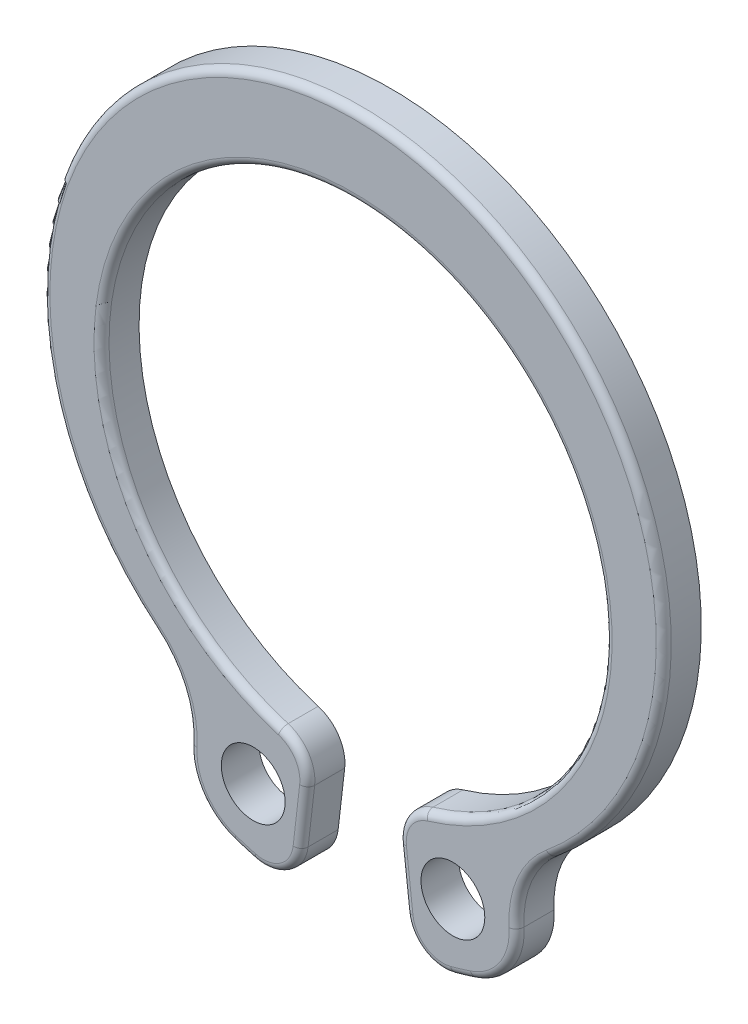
ISO-10303-21;
HEADER;
FILE_DESCRIPTION(('STEP AP214'),'2;1');
FILE_NAME('part.step','',(''),(''),'','','');
FILE_SCHEMA(('AUTOMOTIVE_DESIGN { 1 0 10303 214 1 1 1 1 }'));
ENDSEC;
DATA;
#1=APPLICATION_CONTEXT('core data for automotive mechanical design processes');
#2=APPLICATION_PROTOCOL_DEFINITION('international standard','automotive_design',2000,#1);
#3=PRODUCT_CONTEXT('',#1,'mechanical');
#4=PRODUCT('Part','Part','',(#3));
#5=PRODUCT_RELATED_PRODUCT_CATEGORY('part','',(#4));
#6=PRODUCT_DEFINITION_FORMATION('','',#4);
#7=PRODUCT_DEFINITION_CONTEXT('part definition',#1,'design');
#8=PRODUCT_DEFINITION('design','',#6,#7);
#9=PRODUCT_DEFINITION_SHAPE('','',#8);
#10=(LENGTH_UNIT() NAMED_UNIT(*) SI_UNIT(.MILLI.,.METRE.));
#11=(NAMED_UNIT(*) PLANE_ANGLE_UNIT() SI_UNIT($,.RADIAN.));
#12=(NAMED_UNIT(*) SI_UNIT($,.STERADIAN.) SOLID_ANGLE_UNIT());
#13=UNCERTAINTY_MEASURE_WITH_UNIT(LENGTH_MEASURE(1.E-05),#10,'distance_accuracy_value','');
#14=(GEOMETRIC_REPRESENTATION_CONTEXT(3) GLOBAL_UNCERTAINTY_ASSIGNED_CONTEXT((#13)) GLOBAL_UNIT_ASSIGNED_CONTEXT((#10,
#11,#12)) REPRESENTATION_CONTEXT('',''));
#15=CARTESIAN_POINT('',(0.,0.,0.));
#16=DIRECTION('',(0.,0.,1.));
#17=DIRECTION('',(1.,0.,0.));
#18=AXIS2_PLACEMENT_3D('',#15,#16,#17);
#19=CARTESIAN_POINT('',(0.,0.,1.));
#20=DIRECTION('',(0.,0.,1.));
#21=DIRECTION('',(1.,0.,0.));
#22=AXIS2_PLACEMENT_3D('',#19,#20,#21);
#23=PLANE('',#22);
#24=DIRECTION('',(0.115000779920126,0.99336540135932,0.));
#25=VECTOR('',#24,1.);
#26=CARTESIAN_POINT('',(-1.42123311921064,-7.46625817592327,1.));
#27=LINE('',#26,#25);
#28=CARTESIAN_POINT('',(-1.59563669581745,-8.97273907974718,1.));
#29=VERTEX_POINT('',#28);
#30=CARTESIAN_POINT('',(-1.42123311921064,-7.46625817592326,1.));
#31=VERTEX_POINT('',#30);
#32=EDGE_CURVE('E279',#29,#31,#27,.T.);
#33=ORIENTED_EDGE('',*,*,#32,.T.);
#34=CARTESIAN_POINT('',(-2.21592544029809,-7.37425755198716,1.));
#35=DIRECTION('',(0.,0.,1.));
#36=DIRECTION('',(1.,0.,0.));
#37=AXIS2_PLACEMENT_3D('',#34,#35,#36);
#38=CIRCLE('',#37,0.8);
#39=CARTESIAN_POINT('',(-1.98569942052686,-6.60810092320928,1.));
#40=VERTEX_POINT('',#39);
#41=EDGE_CURVE('E281',#31,#40,#38,.T.);
#42=ORIENTED_EDGE('',*,*,#41,.T.);
#43=CARTESIAN_POINT('',(0.,0.,1.));
#44=DIRECTION('',(0.,0.,1.));
#45=DIRECTION('',(1.,0.,0.));
#46=AXIS2_PLACEMENT_3D('',#43,#44,#45);
#47=CIRCLE('',#46,6.9);
#48=CARTESIAN_POINT('',(1.98569942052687,-6.60810092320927,1.));
#49=VERTEX_POINT('',#48);
#50=EDGE_CURVE('E255',#40,#49,#47,.F.);
#51=ORIENTED_EDGE('',*,*,#50,.T.);
#52=CARTESIAN_POINT('',(2.2159254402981,-7.37425755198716,1.));
#53=DIRECTION('',(0.,0.,1.));
#54=DIRECTION('',(1.,0.,0.));
#55=AXIS2_PLACEMENT_3D('',#52,#53,#54);
#56=CIRCLE('',#55,0.8);
#57=CARTESIAN_POINT('',(1.42123311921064,-7.46625817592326,1.));
#58=VERTEX_POINT('',#57);
#59=EDGE_CURVE('E257',#49,#58,#56,.T.);
#60=ORIENTED_EDGE('',*,*,#59,.T.);
#61=DIRECTION('',(0.115000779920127,-0.99336540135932,0.));
#62=VECTOR('',#61,1.);
#63=CARTESIAN_POINT('',(1.59563669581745,-8.97273907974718,1.));
#64=LINE('',#63,#62);
#65=CARTESIAN_POINT('',(1.59563669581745,-8.97273907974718,1.));
#66=VERTEX_POINT('',#65);
#67=EDGE_CURVE('E259',#58,#66,#64,.T.);
#68=ORIENTED_EDGE('',*,*,#67,.T.);
#69=CARTESIAN_POINT('',(2.39032901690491,-8.88073845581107,1.));
#70=DIRECTION('',(0.,0.,1.));
#71=DIRECTION('',(1.,0.,0.));
#72=AXIS2_PLACEMENT_3D('',#69,#70,#71);
#73=CIRCLE('',#72,0.8);
#74=CARTESIAN_POINT('',(2.59825596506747,-9.65324501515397,1.));
#75=VERTEX_POINT('',#74);
#76=EDGE_CURVE('E261',#66,#75,#73,.T.);
#77=ORIENTED_EDGE('',*,*,#76,.T.);
#78=CARTESIAN_POINT('',(0.,0.,1.));
#79=DIRECTION('',(0.,0.,1.));
#80=DIRECTION('',(1.,0.,0.));
#81=AXIS2_PLACEMENT_3D('',#78,#79,#80);
#82=CIRCLE('',#81,9.99680315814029);
#83=CARTESIAN_POINT('',(3.12827428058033,-9.49473398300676,1.));
#84=VERTEX_POINT('',#83);
#85=EDGE_CURVE('E263',#75,#84,#82,.T.);
#86=ORIENTED_EDGE('',*,*,#85,.T.);
#87=CARTESIAN_POINT('',(2.65888308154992,-8.07006844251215,1.));
#88=DIRECTION('',(0.,0.,1.));
#89=DIRECTION('',(1.,0.,0.));
#90=AXIS2_PLACEMENT_3D('',#87,#88,#89);
#91=CIRCLE('',#90,1.5);
#92=CARTESIAN_POINT('',(4.15617696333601,-7.98000717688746,1.));
#93=VERTEX_POINT('',#92);
#94=EDGE_CURVE('E265',#84,#93,#91,.T.);
#95=ORIENTED_EDGE('',*,*,#94,.T.);
#96=CARTESIAN_POINT('',(6.90121574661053,-7.81489485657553,1.));
#97=DIRECTION('',(0.,0.,1.));
#98=DIRECTION('',(1.,0.,0.));
#99=AXIS2_PLACEMENT_3D('',#96,#97,#98);
#100=CIRCLE('',#99,2.75);
#101=CARTESIAN_POINT('',(5.14802006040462,-5.69621486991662,1.));
#102=VERTEX_POINT('',#101);
#103=EDGE_CURVE('E267',#93,#102,#100,.F.);
#104=ORIENTED_EDGE('',*,*,#103,.T.);
#105=CARTESIAN_POINT('',(0.,0.525,1.));
#106=DIRECTION('',(0.,0.,1.));
#107=DIRECTION('',(1.,0.,0.));
#108=AXIS2_PLACEMENT_3D('',#105,#106,#107);
#109=CIRCLE('',#108,8.075);
#110=CARTESIAN_POINT('',(-5.14802006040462,-5.69621486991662,1.));
#111=VERTEX_POINT('',#110);
#112=EDGE_CURVE('E269',#102,#111,#109,.T.);
#113=ORIENTED_EDGE('',*,*,#112,.T.);
#114=CARTESIAN_POINT('',(-6.90121574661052,-7.81489485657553,1.));
#115=DIRECTION('',(0.,0.,1.));
#116=DIRECTION('',(1.,0.,0.));
#117=AXIS2_PLACEMENT_3D('',#114,#115,#116);
#118=CIRCLE('',#117,2.75);
#119=CARTESIAN_POINT('',(-4.15617696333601,-7.98000717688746,1.));
#120=VERTEX_POINT('',#119);
#121=EDGE_CURVE('E271',#111,#120,#118,.F.);
#122=ORIENTED_EDGE('',*,*,#121,.T.);
#123=CARTESIAN_POINT('',(-2.65888308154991,-8.07006844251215,1.));
#124=DIRECTION('',(0.,0.,1.));
#125=DIRECTION('',(1.,0.,0.));
#126=AXIS2_PLACEMENT_3D('',#123,#124,#125);
#127=CIRCLE('',#126,1.5);
#128=CARTESIAN_POINT('',(-3.12827428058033,-9.49473398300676,1.));
#129=VERTEX_POINT('',#128);
#130=EDGE_CURVE('E273',#120,#129,#127,.T.);
#131=ORIENTED_EDGE('',*,*,#130,.T.);
#132=CARTESIAN_POINT('',(0.,0.,1.));
#133=DIRECTION('',(0.,0.,1.));
#134=DIRECTION('',(1.,0.,0.));
#135=AXIS2_PLACEMENT_3D('',#132,#133,#134);
#136=CIRCLE('',#135,9.99680315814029);
#137=CARTESIAN_POINT('',(-2.59825596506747,-9.65324501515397,1.));
#138=VERTEX_POINT('',#137);
#139=EDGE_CURVE('E275',#129,#138,#136,.T.);
#140=ORIENTED_EDGE('',*,*,#139,.T.);
#141=CARTESIAN_POINT('',(-2.39032901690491,-8.88073845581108,1.));
#142=DIRECTION('',(0.,0.,1.));
#143=DIRECTION('',(1.,0.,0.));
#144=AXIS2_PLACEMENT_3D('',#141,#142,#143);
#145=CIRCLE('',#144,0.8);
#146=EDGE_CURVE('E277',#138,#29,#145,.T.);
#147=ORIENTED_EDGE('',*,*,#146,.T.);
#148=EDGE_LOOP('',(#33,#42,#51,#60,#68,#77,#86,#95,#104,#113,#122,#131,#140,#147));
#149=FACE_BOUND('',#148,.T.);
#150=CARTESIAN_POINT('',(-2.65888308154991,-8.07006844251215,1.));
#151=DIRECTION('',(0.,0.,1.));
#152=DIRECTION('',(-1.,0.,0.));
#153=AXIS2_PLACEMENT_3D('',#150,#151,#152);
#154=CIRCLE('',#153,0.85);
#155=CARTESIAN_POINT('',(-3.50888308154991,-8.07006844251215,1.));
#156=VERTEX_POINT('',#155);
#157=EDGE_CURVE('E414',#156,#156,#154,.T.);
#158=ORIENTED_EDGE('',*,*,#157,.F.);
#159=EDGE_LOOP('',(#158));
#160=FACE_BOUND('',#159,.T.);
#161=CARTESIAN_POINT('',(2.65888308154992,-8.07006844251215,1.));
#162=DIRECTION('',(0.,0.,1.));
#163=DIRECTION('',(1.,0.,0.));
#164=AXIS2_PLACEMENT_3D('',#161,#162,#163);
#165=CIRCLE('',#164,0.85);
#166=CARTESIAN_POINT('',(3.50888308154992,-8.07006844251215,1.));
#167=VERTEX_POINT('',#166);
#168=EDGE_CURVE('E408',#167,#167,#165,.T.);
#169=ORIENTED_EDGE('',*,*,#168,.F.);
#170=EDGE_LOOP('',(#169));
#171=FACE_BOUND('',#170,.T.);
#172=ADVANCED_FACE('F32',(#149,#160,#171),#23,.T.);
#173=CARTESIAN_POINT('',(0.,0.,0.));
#174=DIRECTION('',(0.,0.,1.));
#175=DIRECTION('',(1.,0.,0.));
#176=AXIS2_PLACEMENT_3D('',#173,#174,#175);
#177=PLANE('',#176);
#178=CARTESIAN_POINT('',(-2.65888308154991,-8.07006844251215,0.));
#179=DIRECTION('',(0.,0.,1.));
#180=DIRECTION('',(-1.,0.,0.));
#181=AXIS2_PLACEMENT_3D('',#178,#179,#180);
#182=CIRCLE('',#181,0.85);
#183=CARTESIAN_POINT('',(-3.50888308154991,-8.07006844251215,0.));
#184=VERTEX_POINT('',#183);
#185=EDGE_CURVE('E411',#184,#184,#182,.T.);
#186=ORIENTED_EDGE('',*,*,#185,.T.);
#187=EDGE_LOOP('',(#186));
#188=FACE_BOUND('',#187,.T.);
#189=CARTESIAN_POINT('',(0.,0.,0.));
#190=DIRECTION('',(0.,0.,1.));
#191=DIRECTION('',(1.,0.,0.));
#192=AXIS2_PLACEMENT_3D('',#189,#190,#191);
#193=CIRCLE('',#192,10.1968031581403);
#194=CARTESIAN_POINT('',(2.65023770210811,-9.8463716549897,0.));
#195=VERTEX_POINT('',#194);
#196=CARTESIAN_POINT('',(3.19085977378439,-9.68468938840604,0.));
#197=VERTEX_POINT('',#196);
#198=EDGE_CURVE('E190',#195,#197,#193,.T.);
#199=ORIENTED_EDGE('',*,*,#198,.F.);
#200=CARTESIAN_POINT('',(2.39032901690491,-8.88073845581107,0.));
#201=DIRECTION('',(0.,0.,1.));
#202=DIRECTION('',(1.,0.,0.));
#203=AXIS2_PLACEMENT_3D('',#200,#201,#202);
#204=CIRCLE('',#203,1.);
#205=CARTESIAN_POINT('',(1.39696361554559,-8.9957392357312,0.));
#206=VERTEX_POINT('',#205);
#207=EDGE_CURVE('E237',#195,#206,#204,.F.);
#208=ORIENTED_EDGE('',*,*,#207,.T.);
#209=DIRECTION('',(0.115000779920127,-0.99336540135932,0.));
#210=VECTOR('',#209,1.);
#211=CARTESIAN_POINT('',(1.12026908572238,-6.60567916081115,0.));
#212=LINE('',#211,#210);
#213=CARTESIAN_POINT('',(1.22256003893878,-7.48925833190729,0.));
#214=VERTEX_POINT('',#213);
#215=EDGE_CURVE('E195',#214,#206,#212,.T.);
#216=ORIENTED_EDGE('',*,*,#215,.F.);
#217=CARTESIAN_POINT('',(2.2159254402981,-7.37425755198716,0.));
#218=DIRECTION('',(0.,0.,1.));
#219=DIRECTION('',(1.,0.,0.));
#220=AXIS2_PLACEMENT_3D('',#217,#218,#219);
#221=CIRCLE('',#220,1.);
#222=CARTESIAN_POINT('',(1.92814291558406,-6.41656176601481,0.));
#223=VERTEX_POINT('',#222);
#224=EDGE_CURVE('E233',#214,#223,#221,.F.);
#225=ORIENTED_EDGE('',*,*,#224,.T.);
#226=CARTESIAN_POINT('',(0.,0.,0.));
#227=DIRECTION('',(0.,0.,-1.));
#228=DIRECTION('',(1.,0.,0.));
#229=AXIS2_PLACEMENT_3D('',#226,#227,#228);
#230=CIRCLE('',#229,6.7);
#231=CARTESIAN_POINT('',(-1.92814291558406,-6.41656176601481,0.));
#232=VERTEX_POINT('',#231);
#233=EDGE_CURVE('E417',#232,#223,#230,.T.);
#234=ORIENTED_EDGE('',*,*,#233,.F.);
#235=CARTESIAN_POINT('',(-2.21592544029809,-7.37425755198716,0.));
#236=DIRECTION('',(0.,0.,1.));
#237=DIRECTION('',(1.,0.,0.));
#238=AXIS2_PLACEMENT_3D('',#235,#236,#237);
#239=CIRCLE('',#238,1.);
#240=CARTESIAN_POINT('',(-1.22256003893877,-7.48925833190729,0.));
#241=VERTEX_POINT('',#240);
#242=EDGE_CURVE('E231',#232,#241,#239,.F.);
#243=ORIENTED_EDGE('',*,*,#242,.T.);
#244=DIRECTION('',(0.115000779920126,0.99336540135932,0.));
#245=VECTOR('',#244,1.);
#246=CARTESIAN_POINT('',(-1.12026908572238,-6.60567916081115,0.));
#247=LINE('',#246,#245);
#248=CARTESIAN_POINT('',(-1.39696361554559,-8.9957392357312,0.));
#249=VERTEX_POINT('',#248);
#250=EDGE_CURVE('E218',#249,#241,#247,.T.);
#251=ORIENTED_EDGE('',*,*,#250,.F.);
#252=CARTESIAN_POINT('',(-2.39032901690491,-8.88073845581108,0.));
#253=DIRECTION('',(0.,0.,1.));
#254=DIRECTION('',(1.,0.,0.));
#255=AXIS2_PLACEMENT_3D('',#252,#253,#254);
#256=CIRCLE('',#255,1.);
#257=CARTESIAN_POINT('',(-2.65023770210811,-9.8463716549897,0.));
#258=VERTEX_POINT('',#257);
#259=EDGE_CURVE('E235',#249,#258,#256,.F.);
#260=ORIENTED_EDGE('',*,*,#259,.T.);
#261=CARTESIAN_POINT('',(0.,0.,0.));
#262=DIRECTION('',(0.,0.,1.));
#263=DIRECTION('',(-1.,0.,0.));
#264=AXIS2_PLACEMENT_3D('',#261,#262,#263);
#265=CIRCLE('',#264,10.1968031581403);
#266=CARTESIAN_POINT('',(-3.19085977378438,-9.68468938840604,0.));
#267=VERTEX_POINT('',#266);
#268=EDGE_CURVE('E215',#267,#258,#265,.T.);
#269=ORIENTED_EDGE('',*,*,#268,.F.);
#270=CARTESIAN_POINT('',(-2.65888308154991,-8.07006844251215,0.));
#271=DIRECTION('',(0.,0.,1.));
#272=DIRECTION('',(-1.,0.,0.));
#273=AXIS2_PLACEMENT_3D('',#270,#271,#272);
#274=CIRCLE('',#273,1.7);
#275=CARTESIAN_POINT('',(-4.35581614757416,-7.9679990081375,0.));
#276=VERTEX_POINT('',#275);
#277=EDGE_CURVE('E212',#276,#267,#274,.T.);
#278=ORIENTED_EDGE('',*,*,#277,.F.);
#279=CARTESIAN_POINT('',(-6.90121574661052,-7.81489485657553,0.));
#280=DIRECTION('',(0.,0.,-1.));
#281=DIRECTION('',(-1.,0.,0.));
#282=AXIS2_PLACEMENT_3D('',#279,#280,#281);
#283=CIRCLE('',#282,2.55);
#284=CARTESIAN_POINT('',(-5.27552520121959,-5.85030068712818,0.));
#285=VERTEX_POINT('',#284);
#286=EDGE_CURVE('E209',#285,#276,#283,.T.);
#287=ORIENTED_EDGE('',*,*,#286,.F.);
#288=CARTESIAN_POINT('',(0.,0.525,0.));
#289=DIRECTION('',(0.,0.,1.));
#290=DIRECTION('',(1.,0.,0.));
#291=AXIS2_PLACEMENT_3D('',#288,#289,#290);
#292=CIRCLE('',#291,8.275);
#293=CARTESIAN_POINT('',(5.27552520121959,-5.85030068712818,0.));
#294=VERTEX_POINT('',#293);
#295=EDGE_CURVE('E203',#294,#285,#292,.T.);
#296=ORIENTED_EDGE('',*,*,#295,.F.);
#297=CARTESIAN_POINT('',(6.90121574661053,-7.81489485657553,0.));
#298=DIRECTION('',(0.,0.,-1.));
#299=DIRECTION('',(1.,0.,0.));
#300=AXIS2_PLACEMENT_3D('',#297,#298,#299);
#301=CIRCLE('',#300,2.55);
#302=CARTESIAN_POINT('',(4.35581614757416,-7.9679990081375,0.));
#303=VERTEX_POINT('',#302);
#304=EDGE_CURVE('E201',#303,#294,#301,.T.);
#305=ORIENTED_EDGE('',*,*,#304,.F.);
#306=CARTESIAN_POINT('',(2.65888308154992,-8.07006844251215,0.));
#307=DIRECTION('',(0.,0.,1.));
#308=DIRECTION('',(1.,0.,0.));
#309=AXIS2_PLACEMENT_3D('',#306,#307,#308);
#310=CIRCLE('',#309,1.7);
#311=EDGE_CURVE('E180',#197,#303,#310,.T.);
#312=ORIENTED_EDGE('',*,*,#311,.F.);
#313=EDGE_LOOP('',(#199,#208,#216,#225,#234,#243,#251,#260,#269,#278,#287,#296,#305,#312));
#314=FACE_BOUND('',#313,.T.);
#315=CARTESIAN_POINT('',(2.65888308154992,-8.07006844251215,0.));
#316=DIRECTION('',(0.,0.,1.));
#317=DIRECTION('',(1.,0.,0.));
#318=AXIS2_PLACEMENT_3D('',#315,#316,#317);
#319=CIRCLE('',#318,0.85);
#320=CARTESIAN_POINT('',(3.50888308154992,-8.07006844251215,0.));
#321=VERTEX_POINT('',#320);
#322=EDGE_CURVE('E405',#321,#321,#319,.T.);
#323=ORIENTED_EDGE('',*,*,#322,.T.);
#324=EDGE_LOOP('',(#323));
#325=FACE_BOUND('',#324,.T.);
#326=ADVANCED_FACE('F197',(#188,#314,#325),#177,.F.);
#327=CARTESIAN_POINT('',(0.,0.,1.));
#328=DIRECTION('',(0.,0.,-1.));
#329=DIRECTION('',(-1.,0.,0.));
#330=AXIS2_PLACEMENT_3D('',#327,#328,#329);
#331=CYLINDRICAL_SURFACE('',#330,6.7);
#332=DIRECTION('',(0.,0.,-1.));
#333=VECTOR('',#332,1.);
#334=CARTESIAN_POINT('',(1.92814291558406,-6.41656176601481,1.));
#335=LINE('',#334,#333);
#336=CARTESIAN_POINT('',(1.92814291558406,-6.41656176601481,0.8));
#337=VERTEX_POINT('',#336);
#338=EDGE_CURVE('E253',#223,#337,#335,.F.);
#339=ORIENTED_EDGE('',*,*,#338,.T.);
#340=CARTESIAN_POINT('',(0.,0.,0.8));
#341=DIRECTION('',(0.,0.,1.));
#342=DIRECTION('',(1.,0.,0.));
#343=AXIS2_PLACEMENT_3D('',#340,#341,#342);
#344=CIRCLE('',#343,6.7);
#345=CARTESIAN_POINT('',(-1.92814291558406,-6.41656176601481,0.8));
#346=VERTEX_POINT('',#345);
#347=EDGE_CURVE('E11',#337,#346,#344,.T.);
#348=ORIENTED_EDGE('',*,*,#347,.T.);
#349=DIRECTION('',(0.,0.,-1.));
#350=VECTOR('',#349,1.);
#351=CARTESIAN_POINT('',(-1.92814291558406,-6.41656176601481,1.));
#352=LINE('',#351,#350);
#353=EDGE_CURVE('E251',#346,#232,#352,.T.);
#354=ORIENTED_EDGE('',*,*,#353,.T.);
#355=ORIENTED_EDGE('',*,*,#233,.T.);
#356=EDGE_LOOP('',(#339,#348,#354,#355));
#357=FACE_BOUND('',#356,.T.);
#358=ADVANCED_FACE('F34',(#357),#331,.F.);
#359=CARTESIAN_POINT('',(1.12026908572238,-6.60567916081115,1.));
#360=DIRECTION('',(0.99336540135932,0.115000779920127,0.));
#361=DIRECTION('',(-0.115000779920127,0.99336540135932,0.));
#362=AXIS2_PLACEMENT_3D('',#359,#360,#361);
#363=PLANE('',#362);
#364=DIRECTION('',(0.,0.,-1.));
#365=VECTOR('',#364,1.);
#366=CARTESIAN_POINT('',(1.39696361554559,-8.9957392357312,1.));
#367=LINE('',#366,#365);
#368=CARTESIAN_POINT('',(1.39696361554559,-8.9957392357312,0.8));
#369=VERTEX_POINT('',#368);
#370=EDGE_CURVE('E241',#206,#369,#367,.F.);
#371=ORIENTED_EDGE('',*,*,#370,.T.);
#372=DIRECTION('',(0.115000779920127,-0.99336540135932,0.));
#373=VECTOR('',#372,1.);
#374=CARTESIAN_POINT('',(1.22256003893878,-7.48925833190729,0.8));
#375=LINE('',#374,#373);
#376=CARTESIAN_POINT('',(1.22256003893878,-7.48925833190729,0.8));
#377=VERTEX_POINT('',#376);
#378=EDGE_CURVE('E54',#369,#377,#375,.F.);
#379=ORIENTED_EDGE('',*,*,#378,.T.);
#380=DIRECTION('',(0.,0.,-1.));
#381=VECTOR('',#380,1.);
#382=CARTESIAN_POINT('',(1.22256003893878,-7.48925833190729,1.));
#383=LINE('',#382,#381);
#384=EDGE_CURVE('E239',#377,#214,#383,.T.);
#385=ORIENTED_EDGE('',*,*,#384,.T.);
#386=ORIENTED_EDGE('',*,*,#215,.T.);
#387=EDGE_LOOP('',(#371,#379,#385,#386));
#388=FACE_BOUND('',#387,.T.);
#389=ADVANCED_FACE('F315',(#388),#363,.F.);
#390=CARTESIAN_POINT('',(0.,0.,1.));
#391=DIRECTION('',(0.,0.,-1.));
#392=DIRECTION('',(-1.,0.,0.));
#393=AXIS2_PLACEMENT_3D('',#390,#391,#392);
#394=CYLINDRICAL_SURFACE('',#393,10.1968031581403);
#395=DIRECTION('',(0.,0.,-1.));
#396=VECTOR('',#395,1.);
#397=CARTESIAN_POINT('',(3.19085977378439,-9.68468938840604,1.));
#398=LINE('',#397,#396);
#399=CARTESIAN_POINT('',(3.19085977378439,-9.68468938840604,0.8));
#400=VERTEX_POINT('',#399);
#401=EDGE_CURVE('E175',#400,#197,#398,.T.);
#402=ORIENTED_EDGE('',*,*,#401,.F.);
#403=CARTESIAN_POINT('',(0.,0.,0.8));
#404=DIRECTION('',(0.,0.,1.));
#405=DIRECTION('',(1.,0.,0.));
#406=AXIS2_PLACEMENT_3D('',#403,#404,#405);
#407=CIRCLE('',#406,10.1968031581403);
#408=CARTESIAN_POINT('',(2.65023770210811,-9.8463716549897,0.8));
#409=VERTEX_POINT('',#408);
#410=EDGE_CURVE('E302',#400,#409,#407,.F.);
#411=ORIENTED_EDGE('',*,*,#410,.T.);
#412=DIRECTION('',(0.,0.,-1.));
#413=VECTOR('',#412,1.);
#414=CARTESIAN_POINT('',(2.65023770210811,-9.8463716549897,1.));
#415=LINE('',#414,#413);
#416=EDGE_CURVE('E186',#409,#195,#415,.T.);
#417=ORIENTED_EDGE('',*,*,#416,.T.);
#418=ORIENTED_EDGE('',*,*,#198,.T.);
#419=EDGE_LOOP('',(#402,#411,#417,#418));
#420=FACE_BOUND('',#419,.T.);
#421=ADVANCED_FACE('F191',(#420),#394,.T.);
#422=CARTESIAN_POINT('',(2.65888308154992,-8.07006844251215,1.));
#423=DIRECTION('',(0.,0.,-1.));
#424=DIRECTION('',(-1.,0.,0.));
#425=AXIS2_PLACEMENT_3D('',#422,#423,#424);
#426=CYLINDRICAL_SURFACE('',#425,1.7);
#427=DIRECTION('',(0.,0.,-1.));
#428=VECTOR('',#427,1.);
#429=CARTESIAN_POINT('',(4.35581614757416,-7.9679990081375,1.));
#430=LINE('',#429,#428);
#431=CARTESIAN_POINT('',(4.35581614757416,-7.9679990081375,0.8));
#432=VERTEX_POINT('',#431);
#433=EDGE_CURVE('E187',#432,#303,#430,.T.);
#434=ORIENTED_EDGE('',*,*,#433,.F.);
#435=CARTESIAN_POINT('',(2.65888308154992,-8.07006844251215,0.8));
#436=DIRECTION('',(0.,0.,1.));
#437=DIRECTION('',(1.,0.,0.));
#438=AXIS2_PLACEMENT_3D('',#435,#436,#437);
#439=CIRCLE('',#438,1.7);
#440=EDGE_CURVE('E183',#432,#400,#439,.F.);
#441=ORIENTED_EDGE('',*,*,#440,.T.);
#442=ORIENTED_EDGE('',*,*,#401,.T.);
#443=ORIENTED_EDGE('',*,*,#311,.T.);
#444=EDGE_LOOP('',(#434,#441,#442,#443));
#445=FACE_BOUND('',#444,.T.);
#446=ADVANCED_FACE('F178',(#445),#426,.T.);
#447=CARTESIAN_POINT('',(6.90121574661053,-7.81489485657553,1.));
#448=DIRECTION('',(0.,0.,-1.));
#449=DIRECTION('',(-1.,0.,0.));
#450=AXIS2_PLACEMENT_3D('',#447,#448,#449);
#451=CYLINDRICAL_SURFACE('',#450,2.55);
#452=DIRECTION('',(0.,0.,-1.));
#453=VECTOR('',#452,1.);
#454=CARTESIAN_POINT('',(5.27552520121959,-5.85030068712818,1.));
#455=LINE('',#454,#453);
#456=CARTESIAN_POINT('',(5.27552520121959,-5.85030068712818,0.8));
#457=VERTEX_POINT('',#456);
#458=EDGE_CURVE('E227',#457,#294,#455,.T.);
#459=ORIENTED_EDGE('',*,*,#458,.F.);
#460=CARTESIAN_POINT('',(6.90121574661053,-7.81489485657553,0.8));
#461=DIRECTION('',(0.,0.,1.));
#462=DIRECTION('',(1.,0.,0.));
#463=AXIS2_PLACEMENT_3D('',#460,#461,#462);
#464=CIRCLE('',#463,2.55);
#465=EDGE_CURVE('E299',#457,#432,#464,.T.);
#466=ORIENTED_EDGE('',*,*,#465,.T.);
#467=ORIENTED_EDGE('',*,*,#433,.T.);
#468=ORIENTED_EDGE('',*,*,#304,.T.);
#469=EDGE_LOOP('',(#459,#466,#467,#468));
#470=FACE_BOUND('',#469,.T.);
#471=ADVANCED_FACE('F458',(#470),#451,.F.);
#472=CARTESIAN_POINT('',(0.,0.525,1.));
#473=DIRECTION('',(0.,0.,-1.));
#474=DIRECTION('',(-1.,0.,0.));
#475=AXIS2_PLACEMENT_3D('',#472,#473,#474);
#476=CYLINDRICAL_SURFACE('',#475,8.275);
#477=DIRECTION('',(0.,0.,-1.));
#478=VECTOR('',#477,1.);
#479=CARTESIAN_POINT('',(-5.27552520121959,-5.85030068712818,1.));
#480=LINE('',#479,#478);
#481=CARTESIAN_POINT('',(-5.27552520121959,-5.85030068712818,0.8));
#482=VERTEX_POINT('',#481);
#483=EDGE_CURVE('E225',#482,#285,#480,.T.);
#484=ORIENTED_EDGE('',*,*,#483,.F.);
#485=CARTESIAN_POINT('',(0.,0.525,0.8));
#486=DIRECTION('',(0.,0.,1.));
#487=DIRECTION('',(1.,0.,0.));
#488=AXIS2_PLACEMENT_3D('',#485,#486,#487);
#489=CIRCLE('',#488,8.275);
#490=EDGE_CURVE('E297',#482,#457,#489,.F.);
#491=ORIENTED_EDGE('',*,*,#490,.T.);
#492=ORIENTED_EDGE('',*,*,#458,.T.);
#493=ORIENTED_EDGE('',*,*,#295,.T.);
#494=EDGE_LOOP('',(#484,#491,#492,#493));
#495=FACE_BOUND('',#494,.T.);
#496=ADVANCED_FACE('F454',(#495),#476,.T.);
#497=CARTESIAN_POINT('',(-6.90121574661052,-7.81489485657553,1.));
#498=DIRECTION('',(0.,0.,-1.));
#499=DIRECTION('',(-1.,0.,0.));
#500=AXIS2_PLACEMENT_3D('',#497,#498,#499);
#501=CYLINDRICAL_SURFACE('',#500,2.55);
#502=DIRECTION('',(0.,0.,-1.));
#503=VECTOR('',#502,1.);
#504=CARTESIAN_POINT('',(-4.35581614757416,-7.9679990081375,1.));
#505=LINE('',#504,#503);
#506=CARTESIAN_POINT('',(-4.35581614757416,-7.9679990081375,0.8));
#507=VERTEX_POINT('',#506);
#508=EDGE_CURVE('E223',#507,#276,#505,.T.);
#509=ORIENTED_EDGE('',*,*,#508,.F.);
#510=CARTESIAN_POINT('',(-6.90121574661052,-7.81489485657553,0.8));
#511=DIRECTION('',(0.,0.,1.));
#512=DIRECTION('',(1.,0.,0.));
#513=AXIS2_PLACEMENT_3D('',#510,#511,#512);
#514=CIRCLE('',#513,2.55);
#515=EDGE_CURVE('E295',#507,#482,#514,.T.);
#516=ORIENTED_EDGE('',*,*,#515,.T.);
#517=ORIENTED_EDGE('',*,*,#483,.T.);
#518=ORIENTED_EDGE('',*,*,#286,.T.);
#519=EDGE_LOOP('',(#509,#516,#517,#518));
#520=FACE_BOUND('',#519,.T.);
#521=ADVANCED_FACE('F450',(#520),#501,.F.);
#522=CARTESIAN_POINT('',(-2.65888308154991,-8.07006844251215,1.));
#523=DIRECTION('',(0.,0.,-1.));
#524=DIRECTION('',(-1.,0.,0.));
#525=AXIS2_PLACEMENT_3D('',#522,#523,#524);
#526=CYLINDRICAL_SURFACE('',#525,1.7);
#527=DIRECTION('',(0.,0.,-1.));
#528=VECTOR('',#527,1.);
#529=CARTESIAN_POINT('',(-3.19085977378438,-9.68468938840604,1.));
#530=LINE('',#529,#528);
#531=CARTESIAN_POINT('',(-3.19085977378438,-9.68468938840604,0.8));
#532=VERTEX_POINT('',#531);
#533=EDGE_CURVE('E221',#532,#267,#530,.T.);
#534=ORIENTED_EDGE('',*,*,#533,.F.);
#535=CARTESIAN_POINT('',(-2.65888308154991,-8.07006844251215,0.8));
#536=DIRECTION('',(0.,0.,1.));
#537=DIRECTION('',(1.,0.,0.));
#538=AXIS2_PLACEMENT_3D('',#535,#536,#537);
#539=CIRCLE('',#538,1.7);
#540=EDGE_CURVE('E293',#532,#507,#539,.F.);
#541=ORIENTED_EDGE('',*,*,#540,.T.);
#542=ORIENTED_EDGE('',*,*,#508,.T.);
#543=ORIENTED_EDGE('',*,*,#277,.T.);
#544=EDGE_LOOP('',(#534,#541,#542,#543));
#545=FACE_BOUND('',#544,.T.);
#546=ADVANCED_FACE('F446',(#545),#526,.T.);
#547=CARTESIAN_POINT('',(0.,0.,1.));
#548=DIRECTION('',(0.,0.,-1.));
#549=DIRECTION('',(-1.,0.,0.));
#550=AXIS2_PLACEMENT_3D('',#547,#548,#549);
#551=CYLINDRICAL_SURFACE('',#550,10.1968031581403);
#552=DIRECTION('',(0.,0.,-1.));
#553=VECTOR('',#552,1.);
#554=CARTESIAN_POINT('',(-2.65023770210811,-9.8463716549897,1.));
#555=LINE('',#554,#553);
#556=CARTESIAN_POINT('',(-2.65023770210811,-9.8463716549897,0.8));
#557=VERTEX_POINT('',#556);
#558=EDGE_CURVE('E248',#258,#557,#555,.F.);
#559=ORIENTED_EDGE('',*,*,#558,.T.);
#560=CARTESIAN_POINT('',(0.,0.,0.8));
#561=DIRECTION('',(0.,0.,1.));
#562=DIRECTION('',(1.,0.,0.));
#563=AXIS2_PLACEMENT_3D('',#560,#561,#562);
#564=CIRCLE('',#563,10.1968031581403);
#565=EDGE_CURVE('E291',#557,#532,#564,.F.);
#566=ORIENTED_EDGE('',*,*,#565,.T.);
#567=ORIENTED_EDGE('',*,*,#533,.T.);
#568=ORIENTED_EDGE('',*,*,#268,.T.);
#569=EDGE_LOOP('',(#559,#566,#567,#568));
#570=FACE_BOUND('',#569,.T.);
#571=ADVANCED_FACE('F443',(#570),#551,.T.);
#572=CARTESIAN_POINT('',(-1.12026908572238,-6.60567916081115,1.));
#573=DIRECTION('',(-0.99336540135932,0.115000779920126,0.));
#574=DIRECTION('',(-0.115000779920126,-0.99336540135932,0.));
#575=AXIS2_PLACEMENT_3D('',#572,#573,#574);
#576=PLANE('',#575);
#577=DIRECTION('',(0.,0.,-1.));
#578=VECTOR('',#577,1.);
#579=CARTESIAN_POINT('',(-1.22256003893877,-7.48925833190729,1.));
#580=LINE('',#579,#578);
#581=CARTESIAN_POINT('',(-1.22256003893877,-7.48925833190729,0.8));
#582=VERTEX_POINT('',#581);
#583=EDGE_CURVE('E243',#241,#582,#580,.F.);
#584=ORIENTED_EDGE('',*,*,#583,.T.);
#585=DIRECTION('',(0.115000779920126,0.99336540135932,0.));
#586=VECTOR('',#585,1.);
#587=CARTESIAN_POINT('',(-1.39696361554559,-8.9957392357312,0.8));
#588=LINE('',#587,#586);
#589=CARTESIAN_POINT('',(-1.39696361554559,-8.9957392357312,0.8));
#590=VERTEX_POINT('',#589);
#591=EDGE_CURVE('E287',#582,#590,#588,.F.);
#592=ORIENTED_EDGE('',*,*,#591,.T.);
#593=DIRECTION('',(0.,0.,-1.));
#594=VECTOR('',#593,1.);
#595=CARTESIAN_POINT('',(-1.39696361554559,-8.9957392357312,1.));
#596=LINE('',#595,#594);
#597=EDGE_CURVE('E246',#590,#249,#596,.T.);
#598=ORIENTED_EDGE('',*,*,#597,.T.);
#599=ORIENTED_EDGE('',*,*,#250,.T.);
#600=EDGE_LOOP('',(#584,#592,#598,#599));
#601=FACE_BOUND('',#600,.T.);
#602=ADVANCED_FACE('F368',(#601),#576,.F.);
#603=CARTESIAN_POINT('',(-2.65888308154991,-8.07006844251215,1.));
#604=DIRECTION('',(0.,0.,-1.));
#605=DIRECTION('',(-1.,0.,0.));
#606=AXIS2_PLACEMENT_3D('',#603,#604,#605);
#607=CYLINDRICAL_SURFACE('',#606,0.85);
#608=ORIENTED_EDGE('',*,*,#157,.T.);
#609=EDGE_LOOP('',(#608));
#610=FACE_BOUND('',#609,.T.);
#611=ORIENTED_EDGE('',*,*,#185,.F.);
#612=EDGE_LOOP('',(#611));
#613=FACE_BOUND('',#612,.T.);
#614=ADVANCED_FACE('F442',(#610,#613),#607,.F.);
#615=CARTESIAN_POINT('',(2.65888308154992,-8.07006844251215,1.));
#616=DIRECTION('',(0.,0.,-1.));
#617=DIRECTION('',(-1.,0.,0.));
#618=AXIS2_PLACEMENT_3D('',#615,#616,#617);
#619=CYLINDRICAL_SURFACE('',#618,0.85);
#620=ORIENTED_EDGE('',*,*,#168,.T.);
#621=EDGE_LOOP('',(#620));
#622=FACE_BOUND('',#621,.T.);
#623=ORIENTED_EDGE('',*,*,#322,.F.);
#624=EDGE_LOOP('',(#623));
#625=FACE_BOUND('',#624,.T.);
#626=ADVANCED_FACE('F482',(#622,#625),#619,.F.);
#627=CARTESIAN_POINT('',(2.39032901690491,-8.88073845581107,1.));
#628=DIRECTION('',(0.,0.,-1.));
#629=DIRECTION('',(-1.,0.,0.));
#630=AXIS2_PLACEMENT_3D('',#627,#628,#629);
#631=CYLINDRICAL_SURFACE('',#630,1.);
#632=ORIENTED_EDGE('',*,*,#416,.F.);
#633=CARTESIAN_POINT('',(2.39032901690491,-8.88073845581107,0.8));
#634=DIRECTION('',(0.,0.,1.));
#635=DIRECTION('',(1.,0.,0.));
#636=AXIS2_PLACEMENT_3D('',#633,#634,#635);
#637=CIRCLE('',#636,1.);
#638=EDGE_CURVE('E304',#409,#369,#637,.F.);
#639=ORIENTED_EDGE('',*,*,#638,.T.);
#640=ORIENTED_EDGE('',*,*,#370,.F.);
#641=ORIENTED_EDGE('',*,*,#207,.F.);
#642=EDGE_LOOP('',(#632,#639,#640,#641));
#643=FACE_BOUND('',#642,.T.);
#644=ADVANCED_FACE('F309',(#643),#631,.T.);
#645=CARTESIAN_POINT('',(-2.39032901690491,-8.88073845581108,1.));
#646=DIRECTION('',(0.,0.,-1.));
#647=DIRECTION('',(-1.,0.,0.));
#648=AXIS2_PLACEMENT_3D('',#645,#646,#647);
#649=CYLINDRICAL_SURFACE('',#648,1.);
#650=ORIENTED_EDGE('',*,*,#597,.F.);
#651=CARTESIAN_POINT('',(-2.39032901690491,-8.88073845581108,0.8));
#652=DIRECTION('',(0.,0.,1.));
#653=DIRECTION('',(1.,0.,0.));
#654=AXIS2_PLACEMENT_3D('',#651,#652,#653);
#655=CIRCLE('',#654,1.);
#656=EDGE_CURVE('E289',#590,#557,#655,.F.);
#657=ORIENTED_EDGE('',*,*,#656,.T.);
#658=ORIENTED_EDGE('',*,*,#558,.F.);
#659=ORIENTED_EDGE('',*,*,#259,.F.);
#660=EDGE_LOOP('',(#650,#657,#658,#659));
#661=FACE_BOUND('',#660,.T.);
#662=ADVANCED_FACE('F372',(#661),#649,.T.);
#663=CARTESIAN_POINT('',(2.2159254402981,-7.37425755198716,1.));
#664=DIRECTION('',(0.,0.,-1.));
#665=DIRECTION('',(-1.,0.,0.));
#666=AXIS2_PLACEMENT_3D('',#663,#664,#665);
#667=CYLINDRICAL_SURFACE('',#666,1.);
#668=ORIENTED_EDGE('',*,*,#384,.F.);
#669=CARTESIAN_POINT('',(2.2159254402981,-7.37425755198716,0.8));
#670=DIRECTION('',(0.,0.,1.));
#671=DIRECTION('',(1.,0.,0.));
#672=AXIS2_PLACEMENT_3D('',#669,#670,#671);
#673=CIRCLE('',#672,1.);
#674=EDGE_CURVE('E40',#377,#337,#673,.F.);
#675=ORIENTED_EDGE('',*,*,#674,.T.);
#676=ORIENTED_EDGE('',*,*,#338,.F.);
#677=ORIENTED_EDGE('',*,*,#224,.F.);
#678=EDGE_LOOP('',(#668,#675,#676,#677));
#679=FACE_BOUND('',#678,.T.);
#680=ADVANCED_FACE('F419',(#679),#667,.T.);
#681=CARTESIAN_POINT('',(-2.21592544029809,-7.37425755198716,1.));
#682=DIRECTION('',(0.,0.,-1.));
#683=DIRECTION('',(-1.,0.,0.));
#684=AXIS2_PLACEMENT_3D('',#681,#682,#683);
#685=CYLINDRICAL_SURFACE('',#684,1.);
#686=ORIENTED_EDGE('',*,*,#353,.F.);
#687=CARTESIAN_POINT('',(-2.21592544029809,-7.37425755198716,0.8));
#688=DIRECTION('',(0.,0.,1.));
#689=DIRECTION('',(1.,0.,0.));
#690=AXIS2_PLACEMENT_3D('',#687,#688,#689);
#691=CIRCLE('',#690,1.);
#692=EDGE_CURVE('E284',#346,#582,#691,.F.);
#693=ORIENTED_EDGE('',*,*,#692,.T.);
#694=ORIENTED_EDGE('',*,*,#583,.F.);
#695=ORIENTED_EDGE('',*,*,#242,.F.);
#696=EDGE_LOOP('',(#686,#693,#694,#695));
#697=FACE_BOUND('',#696,.T.);
#698=ADVANCED_FACE('F352',(#697),#685,.T.);
#699=CARTESIAN_POINT('',(6.90121574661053,-7.81489485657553,0.8));
#700=DIRECTION('',(0.,0.,1.));
#701=DIRECTION('',(1.,0.,0.));
#702=AXIS2_PLACEMENT_3D('',#699,#700,#701);
#703=TOROIDAL_SURFACE('',#702,2.75,0.2);
#704=CARTESIAN_POINT('',(4.15617696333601,-7.98000717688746,0.8));
#705=DIRECTION('',(0.0600408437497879,-0.998195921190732,0.));
#706=DIRECTION('',(0.998195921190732,0.0600408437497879,0.));
#707=AXIS2_PLACEMENT_3D('',#704,#705,#706);
#708=CIRCLE('',#707,0.2);
#709=EDGE_CURVE('E399',#432,#93,#708,.T.);
#710=ORIENTED_EDGE('',*,*,#709,.F.);
#711=ORIENTED_EDGE('',*,*,#465,.F.);
#712=CARTESIAN_POINT('',(5.14802006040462,-5.69621486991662,0.8));
#713=DIRECTION('',(0.770429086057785,0.637525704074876,0.));
#714=DIRECTION('',(-0.637525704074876,0.770429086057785,0.));
#715=AXIS2_PLACEMENT_3D('',#712,#713,#714);
#716=CIRCLE('',#715,0.2);
#717=EDGE_CURVE('E402',#102,#457,#716,.T.);
#718=ORIENTED_EDGE('',*,*,#717,.F.);
#719=ORIENTED_EDGE('',*,*,#103,.F.);
#720=EDGE_LOOP('',(#710,#711,#718,#719));
#721=FACE_BOUND('',#720,.T.);
#722=ADVANCED_FACE('F426',(#721),#703,.T.);
#723=CARTESIAN_POINT('',(0.,0.525,0.8));
#724=DIRECTION('',(0.,0.,1.));
#725=DIRECTION('',(1.,0.,0.));
#726=AXIS2_PLACEMENT_3D('',#723,#724,#725);
#727=TOROIDAL_SURFACE('',#726,8.075,0.2);
#728=ORIENTED_EDGE('',*,*,#717,.T.);
#729=ORIENTED_EDGE('',*,*,#490,.F.);
#730=CARTESIAN_POINT('',(-5.14802006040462,-5.69621486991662,0.8));
#731=DIRECTION('',(0.770429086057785,-0.637525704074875,0.));
#732=DIRECTION('',(0.637525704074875,0.770429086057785,0.));
#733=AXIS2_PLACEMENT_3D('',#730,#731,#732);
#734=CIRCLE('',#733,0.2);
#735=EDGE_CURVE('E396',#111,#482,#734,.T.);
#736=ORIENTED_EDGE('',*,*,#735,.F.);
#737=ORIENTED_EDGE('',*,*,#112,.F.);
#738=EDGE_LOOP('',(#728,#729,#736,#737));
#739=FACE_BOUND('',#738,.T.);
#740=ADVANCED_FACE('F585',(#739),#727,.T.);
#741=CARTESIAN_POINT('',(2.65888308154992,-8.07006844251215,0.8));
#742=DIRECTION('',(0.,0.,1.));
#743=DIRECTION('',(1.,0.,0.));
#744=AXIS2_PLACEMENT_3D('',#741,#742,#743);
#745=TOROIDAL_SURFACE('',#744,1.5,0.2);
#746=ORIENTED_EDGE('',*,*,#709,.T.);
#747=ORIENTED_EDGE('',*,*,#94,.F.);
#748=CARTESIAN_POINT('',(3.12827428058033,-9.49473398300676,0.8));
#749=DIRECTION('',(-0.949777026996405,-0.312927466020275,0.));
#750=DIRECTION('',(0.312927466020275,-0.949777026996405,0.));
#751=AXIS2_PLACEMENT_3D('',#748,#749,#750);
#752=CIRCLE('',#751,0.2);
#753=EDGE_CURVE('E393',#400,#84,#752,.T.);
#754=ORIENTED_EDGE('',*,*,#753,.F.);
#755=ORIENTED_EDGE('',*,*,#440,.F.);
#756=EDGE_LOOP('',(#746,#747,#754,#755));
#757=FACE_BOUND('',#756,.T.);
#758=ADVANCED_FACE('F595',(#757),#745,.T.);
#759=CARTESIAN_POINT('',(-6.90121574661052,-7.81489485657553,0.8));
#760=DIRECTION('',(0.,0.,1.));
#761=DIRECTION('',(1.,0.,0.));
#762=AXIS2_PLACEMENT_3D('',#759,#760,#761);
#763=TOROIDAL_SURFACE('',#762,2.75,0.2);
#764=ORIENTED_EDGE('',*,*,#735,.T.);
#765=ORIENTED_EDGE('',*,*,#515,.F.);
#766=CARTESIAN_POINT('',(-4.15617696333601,-7.98000717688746,0.8));
#767=DIRECTION('',(-0.0600408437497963,-0.998195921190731,0.));
#768=DIRECTION('',(0.998195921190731,-0.0600408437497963,0.));
#769=AXIS2_PLACEMENT_3D('',#766,#767,#768);
#770=CIRCLE('',#769,0.2);
#771=EDGE_CURVE('E390',#120,#507,#770,.T.);
#772=ORIENTED_EDGE('',*,*,#771,.F.);
#773=ORIENTED_EDGE('',*,*,#121,.F.);
#774=EDGE_LOOP('',(#764,#765,#772,#773));
#775=FACE_BOUND('',#774,.T.);
#776=ADVANCED_FACE('F605',(#775),#763,.T.);
#777=CARTESIAN_POINT('',(0.,0.,0.8));
#778=DIRECTION('',(0.,0.,1.));
#779=DIRECTION('',(1.,0.,0.));
#780=AXIS2_PLACEMENT_3D('',#777,#778,#779);
#781=TOROIDAL_SURFACE('',#780,9.99680315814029,0.2);
#782=ORIENTED_EDGE('',*,*,#753,.T.);
#783=ORIENTED_EDGE('',*,*,#85,.F.);
#784=CARTESIAN_POINT('',(2.59825596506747,-9.65324501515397,0.8));
#785=DIRECTION('',(-0.965633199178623,-0.259908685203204,0.));
#786=DIRECTION('',(0.259908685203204,-0.965633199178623,0.));
#787=AXIS2_PLACEMENT_3D('',#784,#785,#786);
#788=CIRCLE('',#787,0.2);
#789=EDGE_CURVE('E388',#409,#75,#788,.T.);
#790=ORIENTED_EDGE('',*,*,#789,.F.);
#791=ORIENTED_EDGE('',*,*,#410,.F.);
#792=EDGE_LOOP('',(#782,#783,#790,#791));
#793=FACE_BOUND('',#792,.T.);
#794=ADVANCED_FACE('F615',(#793),#781,.T.);
#795=CARTESIAN_POINT('',(-2.65888308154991,-8.07006844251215,0.8));
#796=DIRECTION('',(0.,0.,1.));
#797=DIRECTION('',(1.,0.,0.));
#798=AXIS2_PLACEMENT_3D('',#795,#796,#797);
#799=TOROIDAL_SURFACE('',#798,1.5,0.2);
#800=ORIENTED_EDGE('',*,*,#771,.T.);
#801=ORIENTED_EDGE('',*,*,#540,.F.);
#802=CARTESIAN_POINT('',(-3.12827428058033,-9.49473398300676,0.8));
#803=DIRECTION('',(0.949777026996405,-0.312927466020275,0.));
#804=DIRECTION('',(0.312927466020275,0.949777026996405,0.));
#805=AXIS2_PLACEMENT_3D('',#802,#803,#804);
#806=CIRCLE('',#805,0.2);
#807=EDGE_CURVE('E323',#129,#532,#806,.T.);
#808=ORIENTED_EDGE('',*,*,#807,.F.);
#809=ORIENTED_EDGE('',*,*,#130,.F.);
#810=EDGE_LOOP('',(#800,#801,#808,#809));
#811=FACE_BOUND('',#810,.T.);
#812=ADVANCED_FACE('F625',(#811),#799,.T.);
#813=CARTESIAN_POINT('',(2.39032901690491,-8.88073845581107,0.8));
#814=DIRECTION('',(0.,0.,1.));
#815=DIRECTION('',(1.,0.,0.));
#816=AXIS2_PLACEMENT_3D('',#813,#814,#815);
#817=TOROIDAL_SURFACE('',#816,0.8,0.2);
#818=ORIENTED_EDGE('',*,*,#789,.T.);
#819=ORIENTED_EDGE('',*,*,#76,.F.);
#820=CARTESIAN_POINT('',(1.59563669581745,-8.97273907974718,0.8));
#821=DIRECTION('',(-0.115000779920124,0.99336540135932,0.));
#822=DIRECTION('',(-0.99336540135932,-0.115000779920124,0.));
#823=AXIS2_PLACEMENT_3D('',#820,#821,#822);
#824=CIRCLE('',#823,0.2);
#825=EDGE_CURVE('E319',#369,#66,#824,.T.);
#826=ORIENTED_EDGE('',*,*,#825,.F.);
#827=ORIENTED_EDGE('',*,*,#638,.F.);
#828=EDGE_LOOP('',(#818,#819,#826,#827));
#829=FACE_BOUND('',#828,.T.);
#830=ADVANCED_FACE('F320',(#829),#817,.T.);
#831=CARTESIAN_POINT('',(0.,0.,0.8));
#832=DIRECTION('',(0.,0.,1.));
#833=DIRECTION('',(1.,0.,0.));
#834=AXIS2_PLACEMENT_3D('',#831,#832,#833);
#835=TOROIDAL_SURFACE('',#834,9.99680315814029,0.2);
#836=ORIENTED_EDGE('',*,*,#807,.T.);
#837=ORIENTED_EDGE('',*,*,#565,.F.);
#838=CARTESIAN_POINT('',(-2.59825596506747,-9.65324501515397,0.8));
#839=DIRECTION('',(0.965633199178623,-0.259908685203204,0.));
#840=DIRECTION('',(0.259908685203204,0.965633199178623,0.));
#841=AXIS2_PLACEMENT_3D('',#838,#839,#840);
#842=CIRCLE('',#841,0.2);
#843=EDGE_CURVE('E324',#138,#557,#842,.T.);
#844=ORIENTED_EDGE('',*,*,#843,.F.);
#845=ORIENTED_EDGE('',*,*,#139,.F.);
#846=EDGE_LOOP('',(#836,#837,#844,#845));
#847=FACE_BOUND('',#846,.T.);
#848=ADVANCED_FACE('F644',(#847),#835,.T.);
#849=CARTESIAN_POINT('',(0.549508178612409,0.0636159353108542,0.8));
#850=DIRECTION('',(-0.115000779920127,0.99336540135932,0.));
#851=DIRECTION('',(-0.99336540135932,-0.115000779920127,0.));
#852=AXIS2_PLACEMENT_3D('',#849,#850,#851);
#853=CYLINDRICAL_SURFACE('',#852,0.2);
#854=ORIENTED_EDGE('',*,*,#825,.T.);
#855=ORIENTED_EDGE('',*,*,#67,.F.);
#856=CARTESIAN_POINT('',(1.42123311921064,-7.46625817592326,0.8));
#857=DIRECTION('',(-0.115000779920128,0.99336540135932,0.));
#858=DIRECTION('',(-0.99336540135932,-0.115000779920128,0.));
#859=AXIS2_PLACEMENT_3D('',#856,#857,#858);
#860=CIRCLE('',#859,0.2);
#861=EDGE_CURVE('E329',#377,#58,#860,.T.);
#862=ORIENTED_EDGE('',*,*,#861,.F.);
#863=ORIENTED_EDGE('',*,*,#378,.F.);
#864=EDGE_LOOP('',(#854,#855,#862,#863));
#865=FACE_BOUND('',#864,.T.);
#866=ADVANCED_FACE('F327',(#865),#853,.T.);
#867=CARTESIAN_POINT('',(-2.39032901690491,-8.88073845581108,0.8));
#868=DIRECTION('',(0.,0.,1.));
#869=DIRECTION('',(1.,0.,0.));
#870=AXIS2_PLACEMENT_3D('',#867,#868,#869);
#871=TOROIDAL_SURFACE('',#870,0.8,0.2);
#872=ORIENTED_EDGE('',*,*,#843,.T.);
#873=ORIENTED_EDGE('',*,*,#656,.F.);
#874=CARTESIAN_POINT('',(-1.59563669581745,-8.97273907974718,0.8));
#875=DIRECTION('',(0.115000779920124,0.99336540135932,0.));
#876=DIRECTION('',(-0.99336540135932,0.115000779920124,0.));
#877=AXIS2_PLACEMENT_3D('',#874,#875,#876);
#878=CIRCLE('',#877,0.2);
#879=EDGE_CURVE('E332',#29,#590,#878,.T.);
#880=ORIENTED_EDGE('',*,*,#879,.F.);
#881=ORIENTED_EDGE('',*,*,#146,.F.);
#882=EDGE_LOOP('',(#872,#873,#880,#881));
#883=FACE_BOUND('',#882,.T.);
#884=ADVANCED_FACE('F377',(#883),#871,.T.);
#885=CARTESIAN_POINT('',(2.2159254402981,-7.37425755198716,0.8));
#886=DIRECTION('',(0.,0.,1.));
#887=DIRECTION('',(1.,0.,0.));
#888=AXIS2_PLACEMENT_3D('',#885,#886,#887);
#889=TOROIDAL_SURFACE('',#888,0.8,0.2);
#890=ORIENTED_EDGE('',*,*,#861,.T.);
#891=ORIENTED_EDGE('',*,*,#59,.F.);
#892=CARTESIAN_POINT('',(1.98569942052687,-6.60810092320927,0.8));
#893=DIRECTION('',(0.957695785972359,0.287782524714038,0.));
#894=DIRECTION('',(-0.287782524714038,0.957695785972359,0.));
#895=AXIS2_PLACEMENT_3D('',#892,#893,#894);
#896=CIRCLE('',#895,0.2);
#897=EDGE_CURVE('E337',#337,#49,#896,.T.);
#898=ORIENTED_EDGE('',*,*,#897,.F.);
#899=ORIENTED_EDGE('',*,*,#674,.F.);
#900=EDGE_LOOP('',(#890,#891,#898,#899));
#901=FACE_BOUND('',#900,.T.);
#902=ADVANCED_FACE('F335',(#901),#889,.T.);
#903=CARTESIAN_POINT('',(-0.549508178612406,0.0636159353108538,0.8));
#904=DIRECTION('',(-0.115000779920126,-0.99336540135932,0.));
#905=DIRECTION('',(0.99336540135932,-0.115000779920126,0.));
#906=AXIS2_PLACEMENT_3D('',#903,#904,#905);
#907=CYLINDRICAL_SURFACE('',#906,0.2);
#908=ORIENTED_EDGE('',*,*,#879,.T.);
#909=ORIENTED_EDGE('',*,*,#591,.F.);
#910=CARTESIAN_POINT('',(-1.42123311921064,-7.46625817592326,0.8));
#911=DIRECTION('',(0.115000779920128,0.99336540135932,0.));
#912=DIRECTION('',(-0.99336540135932,0.115000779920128,0.));
#913=AXIS2_PLACEMENT_3D('',#910,#911,#912);
#914=CIRCLE('',#913,0.2);
#915=EDGE_CURVE('E341',#31,#582,#914,.T.);
#916=ORIENTED_EDGE('',*,*,#915,.F.);
#917=ORIENTED_EDGE('',*,*,#32,.F.);
#918=EDGE_LOOP('',(#908,#909,#916,#917));
#919=FACE_BOUND('',#918,.T.);
#920=ADVANCED_FACE('F364',(#919),#907,.T.);
#921=CARTESIAN_POINT('',(0.,0.,0.8));
#922=DIRECTION('',(0.,0.,1.));
#923=DIRECTION('',(1.,0.,0.));
#924=AXIS2_PLACEMENT_3D('',#921,#922,#923);
#925=TOROIDAL_SURFACE('',#924,6.9,0.2);
#926=ORIENTED_EDGE('',*,*,#897,.T.);
#927=ORIENTED_EDGE('',*,*,#50,.F.);
#928=CARTESIAN_POINT('',(-1.98569942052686,-6.60810092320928,0.8));
#929=DIRECTION('',(0.957695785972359,-0.287782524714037,0.));
#930=DIRECTION('',(0.287782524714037,0.957695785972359,0.));
#931=AXIS2_PLACEMENT_3D('',#928,#929,#930);
#932=CIRCLE('',#931,0.2);
#933=EDGE_CURVE('E345',#346,#40,#932,.T.);
#934=ORIENTED_EDGE('',*,*,#933,.F.);
#935=ORIENTED_EDGE('',*,*,#347,.F.);
#936=EDGE_LOOP('',(#926,#927,#934,#935));
#937=FACE_BOUND('',#936,.T.);
#938=ADVANCED_FACE('F344',(#937),#925,.T.);
#939=CARTESIAN_POINT('',(-2.21592544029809,-7.37425755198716,0.8));
#940=DIRECTION('',(0.,0.,1.));
#941=DIRECTION('',(1.,0.,0.));
#942=AXIS2_PLACEMENT_3D('',#939,#940,#941);
#943=TOROIDAL_SURFACE('',#942,0.8,0.2);
#944=ORIENTED_EDGE('',*,*,#915,.T.);
#945=ORIENTED_EDGE('',*,*,#692,.F.);
#946=ORIENTED_EDGE('',*,*,#933,.T.);
#947=ORIENTED_EDGE('',*,*,#41,.F.);
#948=EDGE_LOOP('',(#944,#945,#946,#947));
#949=FACE_BOUND('',#948,.T.);
#950=ADVANCED_FACE('F356',(#949),#943,.T.);
#951=CLOSED_SHELL('',(#172,#326,#358,#389,#421,#446,#471,#496,#521,#546,#571,#602,#614,#626,
#644,#662,#680,#698,#722,#740,#758,#776,#794,#812,#830,#848,#866,#884,#902,#920,#938,#950));
#952=MANIFOLD_SOLID_BREP('B2',#951);
#953=ADVANCED_BREP_SHAPE_REPRESENTATION('',(#18,#952),#14);
#954=SHAPE_DEFINITION_REPRESENTATION(#9,#953);
ENDSEC;
END-ISO-10303-21;
